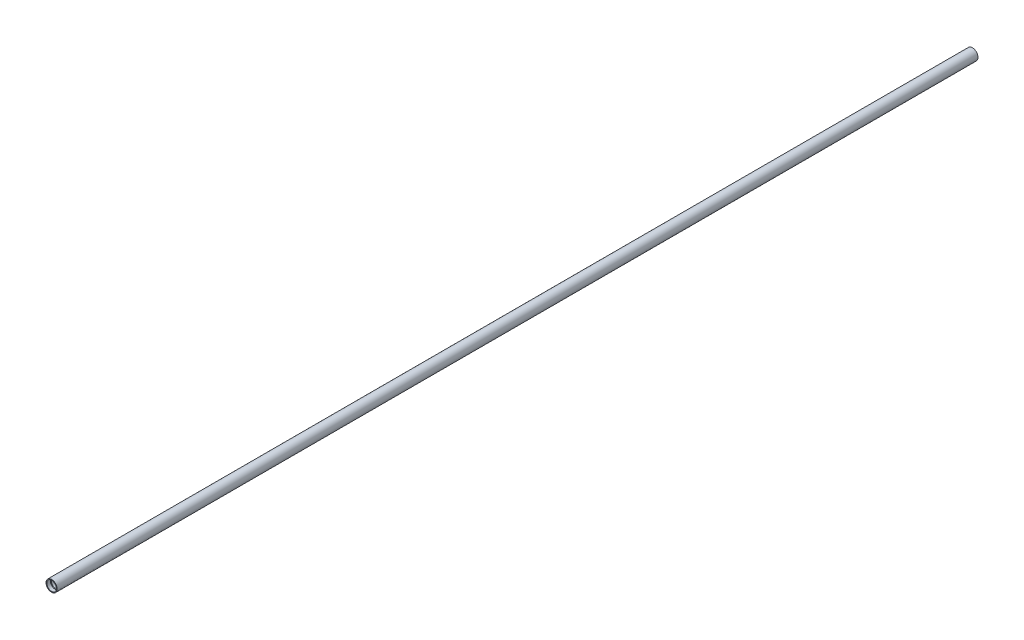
from build123d import *

# Parameters (mm, degrees)
SKETCH2_R                       = 2.3749
EXTRUDE1_DEPTH                  = 196.088
F_29_0_136_DIAMETER_HOLE1_D     = 4.0894
F_29_0_136_DIAMETER_HOLE1_DEPTH = 1.524
F_29_0_136_DIAMETER_HOLE1_TIP   = 1.228579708
F_29_0_136_DIAMETER_HOLE2_D     = 3.556
F_29_0_136_DIAMETER_HOLE2_DEPTH = 39.624
F_29_0_136_DIAMETER_HOLE2_TIP   = 1.068330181
F_26_0_147_DIAMETER_HOLE1_D     = 3.7338
F_26_0_147_DIAMETER_HOLE1_DEPTH = 1.778
F_26_0_147_DIAMETER_HOLE1_TIP   = 1.12174669
F_8_36_TAPPED_HOLE1_D           = 2.6924
F_8_36_TAPPED_HOLE1_DEPTH       = 22.352
F_8_36_TAPPED_HOLE1_TIP         = 0.808878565


with BuildPart() as part:
    # Sketch2 → Extrude1 (new, symmetric)
    with BuildSketch(Plane.XY):
        Circle(SKETCH2_R)
    extrude(amount=EXTRUDE1_DEPTH, both=True)

    # 29 _0.136_ Diameter Hole1
    with Locations(Plane.XY.offset(196.088)):
        with Locations((0, 0)):
            Hole(F_29_0_136_DIAMETER_HOLE1_D / 2, depth=F_29_0_136_DIAMETER_HOLE1_DEPTH)
            with Locations((0, 0, -(F_29_0_136_DIAMETER_HOLE1_DEPTH + F_29_0_136_DIAMETER_HOLE1_TIP / 2))):  # 118° drill point
                Cone(0, F_29_0_136_DIAMETER_HOLE1_D / 2, F_29_0_136_DIAMETER_HOLE1_TIP, mode=Mode.SUBTRACT)

    # 29 _0.136_ Diameter Hole2
    with Locations(Plane.XY.offset(196.088)):
        with Locations((0, 0)):
            Hole(F_29_0_136_DIAMETER_HOLE2_D / 2, depth=F_29_0_136_DIAMETER_HOLE2_DEPTH)
            with Locations((0, 0, -(F_29_0_136_DIAMETER_HOLE2_DEPTH + F_29_0_136_DIAMETER_HOLE2_TIP / 2))):  # 118° drill point
                Cone(0, F_29_0_136_DIAMETER_HOLE2_D / 2, F_29_0_136_DIAMETER_HOLE2_TIP, mode=Mode.SUBTRACT)

    # 26 _0.147_ Diameter Hole1
    with Locations(Plane(origin=(0, 0, -196.088), x_dir=(-1, 0, 0), z_dir=(0, 0, -1))):
        with Locations((0, 0)):
            Hole(F_26_0_147_DIAMETER_HOLE1_D / 2, depth=F_26_0_147_DIAMETER_HOLE1_DEPTH)
            with Locations((0, 0, -(F_26_0_147_DIAMETER_HOLE1_DEPTH + F_26_0_147_DIAMETER_HOLE1_TIP / 2))):  # 118° drill point
                Cone(0, F_26_0_147_DIAMETER_HOLE1_D / 2, F_26_0_147_DIAMETER_HOLE1_TIP, mode=Mode.SUBTRACT)

    # 8-36 Tapped Hole1
    with Locations(Plane(origin=(0, 0, -196.088), x_dir=(-1, 0, 0), z_dir=(0, 0, -1))):
        with Locations((0, 0)):
            Hole(F_8_36_TAPPED_HOLE1_D / 2, depth=F_8_36_TAPPED_HOLE1_DEPTH)
            with Locations((0, 0, -(F_8_36_TAPPED_HOLE1_DEPTH + F_8_36_TAPPED_HOLE1_TIP / 2))):  # 118° drill point
                Cone(0, F_8_36_TAPPED_HOLE1_D / 2, F_8_36_TAPPED_HOLE1_TIP, mode=Mode.SUBTRACT)


solid = part.part
